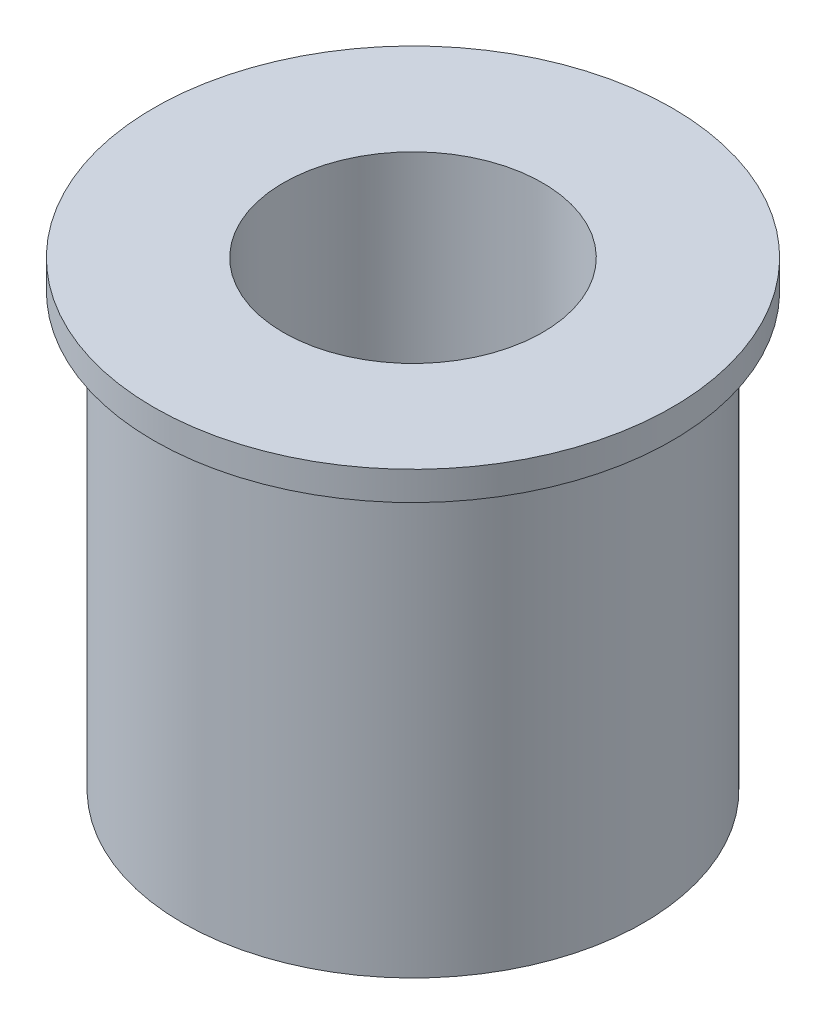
from build123d import *

# Parameters (mm, degrees)
ESQUISSE2_W = 7.26
ESQUISSE2_H = 3


with BuildPart() as part:
    # Esquisse1 → R_volution1 (revolve)
    with BuildSketch(Plane.XY, mode=Mode.PRIVATE) as r_volution1_sk:
        Polygon((4.5, -0.417951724), (4.5, 15.582048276), (9, 15.582048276), (9, 14.582048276), (8, 14.582048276), (8, -0.417951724), align=None)
    revolve(r_volution1_sk.sketch.rotate(Axis((0, 48.273424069, 0), (0, -1, 0)), 90), axis=Axis((0, 48.273424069, 0), (0, -1, 0)))

    # Esquisse2 → Enl_vement de mati_re-R_volution2 (revolve, cut)
    with BuildSketch(Plane.XY):
        with Locations((2.88, 3.082048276)):
            Rectangle(ESQUISSE2_W, ESQUISSE2_H)
    revolve(axis=Axis((-0.75, 8.957406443, 0), (0, -1, 0)), mode=Mode.SUBTRACT)


solid = part.part
